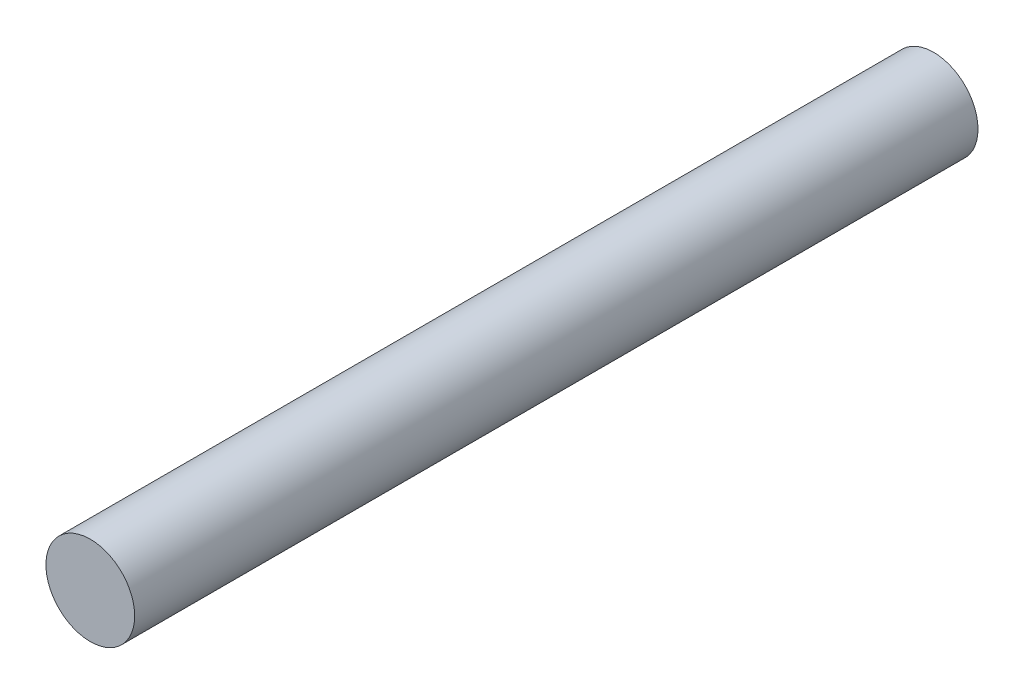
from build123d import *

# Parameters (mm, degrees)
ESQUISSE1_R      = 1
EXTRUSION1_DEPTH = 19


with BuildPart() as part:
    # Esquisse1 → Extrusion1 (new body)
    with BuildSketch(Plane.XY):
        Circle(ESQUISSE1_R)
    extrude(amount=EXTRUSION1_DEPTH)


solid = part.part
